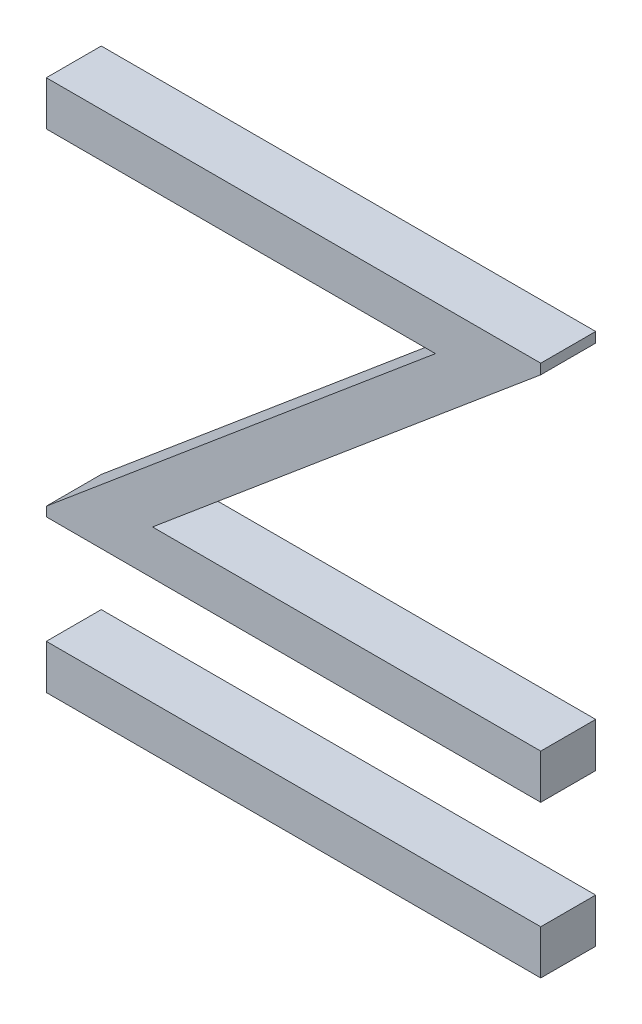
ISO-10303-21;
HEADER;
FILE_DESCRIPTION(('STEP AP214'),'2;1');
FILE_NAME('part.step','',(''),(''),'','','');
FILE_SCHEMA(('AUTOMOTIVE_DESIGN { 1 0 10303 214 1 1 1 1 }'));
ENDSEC;
DATA;
#1=APPLICATION_CONTEXT('core data for automotive mechanical design processes');
#2=APPLICATION_PROTOCOL_DEFINITION('international standard','automotive_design',2000,#1);
#3=PRODUCT_CONTEXT('',#1,'mechanical');
#4=PRODUCT('Part','Part','',(#3));
#5=PRODUCT_RELATED_PRODUCT_CATEGORY('part','',(#4));
#6=PRODUCT_DEFINITION_FORMATION('','',#4);
#7=PRODUCT_DEFINITION_CONTEXT('part definition',#1,'design');
#8=PRODUCT_DEFINITION('design','',#6,#7);
#9=PRODUCT_DEFINITION_SHAPE('','',#8);
#10=(LENGTH_UNIT() NAMED_UNIT(*) SI_UNIT(.MILLI.,.METRE.));
#11=(NAMED_UNIT(*) PLANE_ANGLE_UNIT() SI_UNIT($,.RADIAN.));
#12=(NAMED_UNIT(*) SI_UNIT($,.STERADIAN.) SOLID_ANGLE_UNIT());
#13=UNCERTAINTY_MEASURE_WITH_UNIT(LENGTH_MEASURE(1.E-05),#10,'distance_accuracy_value','');
#14=(GEOMETRIC_REPRESENTATION_CONTEXT(3) GLOBAL_UNCERTAINTY_ASSIGNED_CONTEXT((#13)) GLOBAL_UNIT_ASSIGNED_CONTEXT((#10,
#11,#12)) REPRESENTATION_CONTEXT('',''));
#15=CARTESIAN_POINT('',(0.,0.,0.));
#16=DIRECTION('',(0.,0.,1.));
#17=DIRECTION('',(1.,0.,0.));
#18=AXIS2_PLACEMENT_3D('',#15,#16,#17);
#19=CARTESIAN_POINT('',(195.,47.3076923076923,10.));
#20=DIRECTION('',(1.,0.,0.));
#21=DIRECTION('',(0.,0.,-1.));
#22=AXIS2_PLACEMENT_3D('',#19,#20,#21);
#23=PLANE('',#22);
#24=DIRECTION('',(0.,-1.,0.));
#25=VECTOR('',#24,1.);
#26=CARTESIAN_POINT('',(195.,47.3076923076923,0.));
#27=LINE('',#26,#25);
#28=CARTESIAN_POINT('',(195.,47.3076923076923,0.));
#29=VERTEX_POINT('',#28);
#30=CARTESIAN_POINT('',(195.,39.2307692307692,0.));
#31=VERTEX_POINT('',#30);
#32=EDGE_CURVE('E152',#29,#31,#27,.T.);
#33=ORIENTED_EDGE('',*,*,#32,.F.);
#34=DIRECTION('',(0.,0.,-1.));
#35=VECTOR('',#34,1.);
#36=CARTESIAN_POINT('',(195.,47.3076923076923,10.));
#37=LINE('',#36,#35);
#38=CARTESIAN_POINT('',(195.,47.3076923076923,10.));
#39=VERTEX_POINT('',#38);
#40=EDGE_CURVE('E12',#39,#29,#37,.T.);
#41=ORIENTED_EDGE('',*,*,#40,.F.);
#42=DIRECTION('',(0.,-1.,0.));
#43=VECTOR('',#42,1.);
#44=CARTESIAN_POINT('',(195.,47.3076923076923,10.));
#45=LINE('',#44,#43);
#46=CARTESIAN_POINT('',(195.,39.2307692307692,10.));
#47=VERTEX_POINT('',#46);
#48=EDGE_CURVE('E178',#39,#47,#45,.T.);
#49=ORIENTED_EDGE('',*,*,#48,.T.);
#50=DIRECTION('',(0.,0.,-1.));
#51=VECTOR('',#50,1.);
#52=CARTESIAN_POINT('',(195.,39.2307692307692,10.));
#53=LINE('',#52,#51);
#54=EDGE_CURVE('E46',#47,#31,#53,.T.);
#55=ORIENTED_EDGE('',*,*,#54,.T.);
#56=EDGE_LOOP('',(#33,#41,#49,#55));
#57=FACE_BOUND('',#56,.T.);
#58=ADVANCED_FACE('F43',(#57),#23,.T.);
#59=CARTESIAN_POINT('',(124.326923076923,47.3076923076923,10.));
#60=DIRECTION('',(0.,1.,0.));
#61=DIRECTION('',(0.,0.,1.));
#62=AXIS2_PLACEMENT_3D('',#59,#60,#61);
#63=PLANE('',#62);
#64=DIRECTION('',(1.,0.,0.));
#65=VECTOR('',#64,1.);
#66=CARTESIAN_POINT('',(124.326923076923,47.3076923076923,0.));
#67=LINE('',#66,#65);
#68=CARTESIAN_POINT('',(124.326923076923,47.3076923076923,0.));
#69=VERTEX_POINT('',#68);
#70=EDGE_CURVE('E176',#69,#29,#67,.T.);
#71=ORIENTED_EDGE('',*,*,#70,.F.);
#72=DIRECTION('',(0.,0.,-1.));
#73=VECTOR('',#72,1.);
#74=CARTESIAN_POINT('',(124.326923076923,47.3076923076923,10.));
#75=LINE('',#74,#73);
#76=CARTESIAN_POINT('',(124.326923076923,47.3076923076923,10.));
#77=VERTEX_POINT('',#76);
#78=EDGE_CURVE('E52',#77,#69,#75,.T.);
#79=ORIENTED_EDGE('',*,*,#78,.F.);
#80=DIRECTION('',(1.,0.,0.));
#81=VECTOR('',#80,1.);
#82=CARTESIAN_POINT('',(124.326923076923,47.3076923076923,10.));
#83=LINE('',#82,#81);
#84=EDGE_CURVE('E142',#77,#39,#83,.T.);
#85=ORIENTED_EDGE('',*,*,#84,.T.);
#86=ORIENTED_EDGE('',*,*,#40,.T.);
#87=EDGE_LOOP('',(#71,#79,#85,#86));
#88=FACE_BOUND('',#87,.T.);
#89=ADVANCED_FACE('F194',(#88),#63,.T.);
#90=CARTESIAN_POINT('',(195.,106.622596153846,10.));
#91=DIRECTION('',(0.642871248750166,-0.765974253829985,0.));
#92=DIRECTION('',(0.765974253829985,0.642871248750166,0.));
#93=AXIS2_PLACEMENT_3D('',#90,#91,#92);
#94=PLANE('',#93);
#95=DIRECTION('',(-0.765974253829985,-0.642871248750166,0.));
#96=VECTOR('',#95,1.);
#97=CARTESIAN_POINT('',(195.,106.622596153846,0.));
#98=LINE('',#97,#96);
#99=CARTESIAN_POINT('',(195.,106.622596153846,0.));
#100=VERTEX_POINT('',#99);
#101=EDGE_CURVE('E129',#100,#69,#98,.T.);
#102=ORIENTED_EDGE('',*,*,#101,.F.);
#103=DIRECTION('',(0.,0.,-1.));
#104=VECTOR('',#103,1.);
#105=CARTESIAN_POINT('',(195.,106.622596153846,10.));
#106=LINE('',#105,#104);
#107=CARTESIAN_POINT('',(195.,106.622596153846,10.));
#108=VERTEX_POINT('',#107);
#109=EDGE_CURVE('E124',#108,#100,#106,.T.);
#110=ORIENTED_EDGE('',*,*,#109,.F.);
#111=DIRECTION('',(-0.765974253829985,-0.642871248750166,0.));
#112=VECTOR('',#111,1.);
#113=CARTESIAN_POINT('',(195.,106.622596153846,10.));
#114=LINE('',#113,#112);
#115=EDGE_CURVE('E127',#108,#77,#114,.T.);
#116=ORIENTED_EDGE('',*,*,#115,.T.);
#117=ORIENTED_EDGE('',*,*,#78,.T.);
#118=EDGE_LOOP('',(#102,#110,#116,#117));
#119=FACE_BOUND('',#118,.T.);
#120=ADVANCED_FACE('F126',(#119),#94,.T.);
#121=CARTESIAN_POINT('',(195.,108.461538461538,10.));
#122=DIRECTION('',(1.,0.,0.));
#123=DIRECTION('',(0.,0.,-1.));
#124=AXIS2_PLACEMENT_3D('',#121,#122,#123);
#125=PLANE('',#124);
#126=DIRECTION('',(0.,-1.,0.));
#127=VECTOR('',#126,1.);
#128=CARTESIAN_POINT('',(195.,108.461538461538,0.));
#129=LINE('',#128,#127);
#130=CARTESIAN_POINT('',(195.,108.461538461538,0.));
#131=VERTEX_POINT('',#130);
#132=EDGE_CURVE('E173',#131,#100,#129,.T.);
#133=ORIENTED_EDGE('',*,*,#132,.F.);
#134=DIRECTION('',(0.,0.,-1.));
#135=VECTOR('',#134,1.);
#136=CARTESIAN_POINT('',(195.,108.461538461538,10.));
#137=LINE('',#136,#135);
#138=CARTESIAN_POINT('',(195.,108.461538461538,10.));
#139=VERTEX_POINT('',#138);
#140=EDGE_CURVE('E134',#139,#131,#137,.T.);
#141=ORIENTED_EDGE('',*,*,#140,.F.);
#142=DIRECTION('',(0.,-1.,0.));
#143=VECTOR('',#142,1.);
#144=CARTESIAN_POINT('',(195.,108.461538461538,10.));
#145=LINE('',#144,#143);
#146=EDGE_CURVE('E140',#139,#108,#145,.T.);
#147=ORIENTED_EDGE('',*,*,#146,.T.);
#148=ORIENTED_EDGE('',*,*,#109,.T.);
#149=EDGE_LOOP('',(#133,#141,#147,#148));
#150=FACE_BOUND('',#149,.T.);
#151=ADVANCED_FACE('F144',(#150),#125,.T.);
#152=CARTESIAN_POINT('',(105.,108.461538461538,10.));
#153=DIRECTION('',(0.,1.,0.));
#154=DIRECTION('',(0.,0.,1.));
#155=AXIS2_PLACEMENT_3D('',#152,#153,#154);
#156=PLANE('',#155);
#157=DIRECTION('',(1.,0.,0.));
#158=VECTOR('',#157,1.);
#159=CARTESIAN_POINT('',(105.,108.461538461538,0.));
#160=LINE('',#159,#158);
#161=CARTESIAN_POINT('',(105.,108.461538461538,0.));
#162=VERTEX_POINT('',#161);
#163=EDGE_CURVE('E170',#162,#131,#160,.T.);
#164=ORIENTED_EDGE('',*,*,#163,.F.);
#165=DIRECTION('',(0.,0.,-1.));
#166=VECTOR('',#165,1.);
#167=CARTESIAN_POINT('',(105.,108.461538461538,10.));
#168=LINE('',#167,#166);
#169=CARTESIAN_POINT('',(105.,108.461538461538,10.));
#170=VERTEX_POINT('',#169);
#171=EDGE_CURVE('E182',#170,#162,#168,.T.);
#172=ORIENTED_EDGE('',*,*,#171,.F.);
#173=DIRECTION('',(1.,0.,0.));
#174=VECTOR('',#173,1.);
#175=CARTESIAN_POINT('',(105.,108.461538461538,10.));
#176=LINE('',#175,#174);
#177=EDGE_CURVE('E145',#170,#139,#176,.T.);
#178=ORIENTED_EDGE('',*,*,#177,.T.);
#179=ORIENTED_EDGE('',*,*,#140,.T.);
#180=EDGE_LOOP('',(#164,#172,#178,#179));
#181=FACE_BOUND('',#180,.T.);
#182=ADVANCED_FACE('F207',(#181),#156,.T.);
#183=CARTESIAN_POINT('',(105.,100.384615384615,10.));
#184=DIRECTION('',(-1.,0.,0.));
#185=DIRECTION('',(0.,0.,1.));
#186=AXIS2_PLACEMENT_3D('',#183,#184,#185);
#187=PLANE('',#186);
#188=DIRECTION('',(0.,1.,0.));
#189=VECTOR('',#188,1.);
#190=CARTESIAN_POINT('',(105.,100.384615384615,0.));
#191=LINE('',#190,#189);
#192=CARTESIAN_POINT('',(105.,100.384615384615,0.));
#193=VERTEX_POINT('',#192);
#194=EDGE_CURVE('E167',#193,#162,#191,.T.);
#195=ORIENTED_EDGE('',*,*,#194,.F.);
#196=DIRECTION('',(0.,0.,-1.));
#197=VECTOR('',#196,1.);
#198=CARTESIAN_POINT('',(105.,100.384615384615,10.));
#199=LINE('',#198,#197);
#200=CARTESIAN_POINT('',(105.,100.384615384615,10.));
#201=VERTEX_POINT('',#200);
#202=EDGE_CURVE('E184',#201,#193,#199,.T.);
#203=ORIENTED_EDGE('',*,*,#202,.F.);
#204=DIRECTION('',(0.,1.,0.));
#205=VECTOR('',#204,1.);
#206=CARTESIAN_POINT('',(105.,100.384615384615,10.));
#207=LINE('',#206,#205);
#208=EDGE_CURVE('E147',#201,#170,#207,.T.);
#209=ORIENTED_EDGE('',*,*,#208,.T.);
#210=ORIENTED_EDGE('',*,*,#171,.T.);
#211=EDGE_LOOP('',(#195,#203,#209,#210));
#212=FACE_BOUND('',#211,.T.);
#213=ADVANCED_FACE('F210',(#212),#187,.T.);
#214=CARTESIAN_POINT('',(175.835336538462,100.384615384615,10.));
#215=DIRECTION('',(0.,-1.,0.));
#216=DIRECTION('',(0.,0.,-1.));
#217=AXIS2_PLACEMENT_3D('',#214,#215,#216);
#218=PLANE('',#217);
#219=DIRECTION('',(-1.,0.,0.));
#220=VECTOR('',#219,1.);
#221=CARTESIAN_POINT('',(175.835336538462,100.384615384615,0.));
#222=LINE('',#221,#220);
#223=CARTESIAN_POINT('',(175.835336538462,100.384615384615,0.));
#224=VERTEX_POINT('',#223);
#225=EDGE_CURVE('E164',#224,#193,#222,.T.);
#226=ORIENTED_EDGE('',*,*,#225,.F.);
#227=DIRECTION('',(0.,0.,-1.));
#228=VECTOR('',#227,1.);
#229=CARTESIAN_POINT('',(175.835336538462,100.384615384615,10.));
#230=LINE('',#229,#228);
#231=CARTESIAN_POINT('',(175.835336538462,100.384615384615,10.));
#232=VERTEX_POINT('',#231);
#233=EDGE_CURVE('E186',#232,#224,#230,.T.);
#234=ORIENTED_EDGE('',*,*,#233,.F.);
#235=DIRECTION('',(-1.,0.,0.));
#236=VECTOR('',#235,1.);
#237=CARTESIAN_POINT('',(175.835336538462,100.384615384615,10.));
#238=LINE('',#237,#236);
#239=EDGE_CURVE('E321',#232,#201,#238,.T.);
#240=ORIENTED_EDGE('',*,*,#239,.T.);
#241=ORIENTED_EDGE('',*,*,#202,.T.);
#242=EDGE_LOOP('',(#226,#234,#240,#241));
#243=FACE_BOUND('',#242,.T.);
#244=ADVANCED_FACE('F214',(#243),#218,.T.);
#245=CARTESIAN_POINT('',(105.,40.9254807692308,10.));
#246=DIRECTION('',(-0.642922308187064,0.76593139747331,0.));
#247=DIRECTION('',(-0.76593139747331,-0.642922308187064,0.));
#248=AXIS2_PLACEMENT_3D('',#245,#246,#247);
#249=PLANE('',#248);
#250=DIRECTION('',(0.76593139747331,0.642922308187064,0.));
#251=VECTOR('',#250,1.);
#252=CARTESIAN_POINT('',(105.,40.9254807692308,0.));
#253=LINE('',#252,#251);
#254=CARTESIAN_POINT('',(105.,40.9254807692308,0.));
#255=VERTEX_POINT('',#254);
#256=EDGE_CURVE('E161',#255,#224,#253,.T.);
#257=ORIENTED_EDGE('',*,*,#256,.F.);
#258=DIRECTION('',(0.,0.,-1.));
#259=VECTOR('',#258,1.);
#260=CARTESIAN_POINT('',(105.,40.9254807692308,10.));
#261=LINE('',#260,#259);
#262=CARTESIAN_POINT('',(105.,40.9254807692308,10.));
#263=VERTEX_POINT('',#262);
#264=EDGE_CURVE('E188',#263,#255,#261,.T.);
#265=ORIENTED_EDGE('',*,*,#264,.F.);
#266=DIRECTION('',(0.76593139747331,0.642922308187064,0.));
#267=VECTOR('',#266,1.);
#268=CARTESIAN_POINT('',(105.,40.9254807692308,10.));
#269=LINE('',#268,#267);
#270=EDGE_CURVE('E317',#263,#232,#269,.T.);
#271=ORIENTED_EDGE('',*,*,#270,.T.);
#272=ORIENTED_EDGE('',*,*,#233,.T.);
#273=EDGE_LOOP('',(#257,#265,#271,#272));
#274=FACE_BOUND('',#273,.T.);
#275=ADVANCED_FACE('F218',(#274),#249,.T.);
#276=CARTESIAN_POINT('',(105.,39.2307692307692,10.));
#277=DIRECTION('',(-1.,0.,0.));
#278=DIRECTION('',(0.,0.,1.));
#279=AXIS2_PLACEMENT_3D('',#276,#277,#278);
#280=PLANE('',#279);
#281=DIRECTION('',(0.,1.,0.));
#282=VECTOR('',#281,1.);
#283=CARTESIAN_POINT('',(105.,39.2307692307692,0.));
#284=LINE('',#283,#282);
#285=CARTESIAN_POINT('',(105.,39.2307692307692,0.));
#286=VERTEX_POINT('',#285);
#287=EDGE_CURVE('E158',#286,#255,#284,.T.);
#288=ORIENTED_EDGE('',*,*,#287,.F.);
#289=DIRECTION('',(0.,0.,-1.));
#290=VECTOR('',#289,1.);
#291=CARTESIAN_POINT('',(105.,39.2307692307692,10.));
#292=LINE('',#291,#290);
#293=CARTESIAN_POINT('',(105.,39.2307692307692,10.));
#294=VERTEX_POINT('',#293);
#295=EDGE_CURVE('E189',#294,#286,#292,.T.);
#296=ORIENTED_EDGE('',*,*,#295,.F.);
#297=DIRECTION('',(0.,1.,0.));
#298=VECTOR('',#297,1.);
#299=CARTESIAN_POINT('',(105.,39.2307692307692,10.));
#300=LINE('',#299,#298);
#301=EDGE_CURVE('E328',#294,#263,#300,.T.);
#302=ORIENTED_EDGE('',*,*,#301,.T.);
#303=ORIENTED_EDGE('',*,*,#264,.T.);
#304=EDGE_LOOP('',(#288,#296,#302,#303));
#305=FACE_BOUND('',#304,.T.);
#306=ADVANCED_FACE('F222',(#305),#280,.T.);
#307=CARTESIAN_POINT('',(195.,39.2307692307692,10.));
#308=DIRECTION('',(0.,-1.,0.));
#309=DIRECTION('',(0.,0.,-1.));
#310=AXIS2_PLACEMENT_3D('',#307,#308,#309);
#311=PLANE('',#310);
#312=DIRECTION('',(-1.,0.,0.));
#313=VECTOR('',#312,1.);
#314=CARTESIAN_POINT('',(195.,39.2307692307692,0.));
#315=LINE('',#314,#313);
#316=EDGE_CURVE('E155',#31,#286,#315,.T.);
#317=ORIENTED_EDGE('',*,*,#316,.F.);
#318=ORIENTED_EDGE('',*,*,#54,.F.);
#319=DIRECTION('',(-1.,0.,0.));
#320=VECTOR('',#319,1.);
#321=CARTESIAN_POINT('',(195.,39.2307692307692,10.));
#322=LINE('',#321,#320);
#323=EDGE_CURVE('E330',#47,#294,#322,.T.);
#324=ORIENTED_EDGE('',*,*,#323,.T.);
#325=ORIENTED_EDGE('',*,*,#295,.T.);
#326=EDGE_LOOP('',(#317,#318,#324,#325));
#327=FACE_BOUND('',#326,.T.);
#328=ADVANCED_FACE('F191',(#327),#311,.T.);
#329=CARTESIAN_POINT('',(0.,0.,10.));
#330=DIRECTION('',(0.,0.,-1.));
#331=DIRECTION('',(-1.,0.,0.));
#332=AXIS2_PLACEMENT_3D('',#329,#330,#331);
#333=PLANE('',#332);
#334=ORIENTED_EDGE('',*,*,#48,.F.);
#335=ORIENTED_EDGE('',*,*,#84,.F.);
#336=ORIENTED_EDGE('',*,*,#115,.F.);
#337=ORIENTED_EDGE('',*,*,#146,.F.);
#338=ORIENTED_EDGE('',*,*,#177,.F.);
#339=ORIENTED_EDGE('',*,*,#208,.F.);
#340=ORIENTED_EDGE('',*,*,#239,.F.);
#341=ORIENTED_EDGE('',*,*,#270,.F.);
#342=ORIENTED_EDGE('',*,*,#301,.F.);
#343=ORIENTED_EDGE('',*,*,#323,.F.);
#344=EDGE_LOOP('',(#334,#335,#336,#337,#338,#339,#340,#341,#342,#343));
#345=FACE_BOUND('',#344,.T.);
#346=ADVANCED_FACE('F138',(#345),#333,.F.);
#347=CARTESIAN_POINT('',(0.,0.,0.));
#348=DIRECTION('',(0.,0.,-1.));
#349=DIRECTION('',(-1.,0.,0.));
#350=AXIS2_PLACEMENT_3D('',#347,#348,#349);
#351=PLANE('',#350);
#352=ORIENTED_EDGE('',*,*,#32,.T.);
#353=ORIENTED_EDGE('',*,*,#316,.T.);
#354=ORIENTED_EDGE('',*,*,#287,.T.);
#355=ORIENTED_EDGE('',*,*,#256,.T.);
#356=ORIENTED_EDGE('',*,*,#225,.T.);
#357=ORIENTED_EDGE('',*,*,#194,.T.);
#358=ORIENTED_EDGE('',*,*,#163,.T.);
#359=ORIENTED_EDGE('',*,*,#132,.T.);
#360=ORIENTED_EDGE('',*,*,#101,.T.);
#361=ORIENTED_EDGE('',*,*,#70,.T.);
#362=EDGE_LOOP('',(#352,#353,#354,#355,#356,#357,#358,#359,#360,#361));
#363=FACE_BOUND('',#362,.T.);
#364=ADVANCED_FACE('F193',(#363),#351,.T.);
#365=CLOSED_SHELL('',(#58,#89,#120,#151,#182,#213,#244,#275,#306,#328,#346,#364));
#366=MANIFOLD_SOLID_BREP('B2',#365);
#367=CARTESIAN_POINT('',(195.,11.5384615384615,10.));
#368=DIRECTION('',(0.,-1.,0.));
#369=DIRECTION('',(0.,0.,-1.));
#370=AXIS2_PLACEMENT_3D('',#367,#368,#369);
#371=PLANE('',#370);
#372=DIRECTION('',(-1.,0.,0.));
#373=VECTOR('',#372,1.);
#374=CARTESIAN_POINT('',(195.,11.5384615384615,0.));
#375=LINE('',#374,#373);
#376=CARTESIAN_POINT('',(195.,11.5384615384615,0.));
#377=VERTEX_POINT('',#376);
#378=CARTESIAN_POINT('',(105.,11.5384615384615,0.));
#379=VERTEX_POINT('',#378);
#380=EDGE_CURVE('E399',#377,#379,#375,.T.);
#381=ORIENTED_EDGE('',*,*,#380,.F.);
#382=DIRECTION('',(0.,0.,-1.));
#383=VECTOR('',#382,1.);
#384=CARTESIAN_POINT('',(195.,11.5384615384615,10.));
#385=LINE('',#384,#383);
#386=CARTESIAN_POINT('',(195.,11.5384615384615,10.));
#387=VERTEX_POINT('',#386);
#388=EDGE_CURVE('E41',#387,#377,#385,.T.);
#389=ORIENTED_EDGE('',*,*,#388,.F.);
#390=DIRECTION('',(-1.,0.,0.));
#391=VECTOR('',#390,1.);
#392=CARTESIAN_POINT('',(195.,11.5384615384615,10.));
#393=LINE('',#392,#391);
#394=CARTESIAN_POINT('',(105.,11.5384615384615,10.));
#395=VERTEX_POINT('',#394);
#396=EDGE_CURVE('E393',#387,#395,#393,.T.);
#397=ORIENTED_EDGE('',*,*,#396,.T.);
#398=DIRECTION('',(0.,0.,-1.));
#399=VECTOR('',#398,1.);
#400=CARTESIAN_POINT('',(105.,11.5384615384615,10.));
#401=LINE('',#400,#399);
#402=EDGE_CURVE('E338',#395,#379,#401,.T.);
#403=ORIENTED_EDGE('',*,*,#402,.T.);
#404=EDGE_LOOP('',(#381,#389,#397,#403));
#405=FACE_BOUND('',#404,.T.);
#406=ADVANCED_FACE('F335',(#405),#371,.T.);
#407=CARTESIAN_POINT('',(195.,19.6153846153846,10.));
#408=DIRECTION('',(1.,0.,0.));
#409=DIRECTION('',(0.,0.,-1.));
#410=AXIS2_PLACEMENT_3D('',#407,#408,#409);
#411=PLANE('',#410);
#412=DIRECTION('',(0.,-1.,0.));
#413=VECTOR('',#412,1.);
#414=CARTESIAN_POINT('',(195.,19.6153846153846,0.));
#415=LINE('',#414,#413);
#416=CARTESIAN_POINT('',(195.,19.6153846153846,0.));
#417=VERTEX_POINT('',#416);
#418=EDGE_CURVE('E395',#417,#377,#415,.T.);
#419=ORIENTED_EDGE('',*,*,#418,.F.);
#420=DIRECTION('',(0.,0.,-1.));
#421=VECTOR('',#420,1.);
#422=CARTESIAN_POINT('',(195.,19.6153846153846,10.));
#423=LINE('',#422,#421);
#424=CARTESIAN_POINT('',(195.,19.6153846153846,10.));
#425=VERTEX_POINT('',#424);
#426=EDGE_CURVE('E344',#425,#417,#423,.T.);
#427=ORIENTED_EDGE('',*,*,#426,.F.);
#428=DIRECTION('',(0.,-1.,0.));
#429=VECTOR('',#428,1.);
#430=CARTESIAN_POINT('',(195.,19.6153846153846,10.));
#431=LINE('',#430,#429);
#432=EDGE_CURVE('E390',#425,#387,#431,.T.);
#433=ORIENTED_EDGE('',*,*,#432,.T.);
#434=ORIENTED_EDGE('',*,*,#388,.T.);
#435=EDGE_LOOP('',(#419,#427,#433,#434));
#436=FACE_BOUND('',#435,.T.);
#437=ADVANCED_FACE('F409',(#436),#411,.T.);
#438=CARTESIAN_POINT('',(105.,19.6153846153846,10.));
#439=DIRECTION('',(0.,1.,0.));
#440=DIRECTION('',(0.,0.,1.));
#441=AXIS2_PLACEMENT_3D('',#438,#439,#440);
#442=PLANE('',#441);
#443=DIRECTION('',(1.,0.,0.));
#444=VECTOR('',#443,1.);
#445=CARTESIAN_POINT('',(105.,19.6153846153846,0.));
#446=LINE('',#445,#444);
#447=CARTESIAN_POINT('',(105.,19.6153846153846,0.));
#448=VERTEX_POINT('',#447);
#449=EDGE_CURVE('E385',#448,#417,#446,.T.);
#450=ORIENTED_EDGE('',*,*,#449,.F.);
#451=DIRECTION('',(0.,0.,-1.));
#452=VECTOR('',#451,1.);
#453=CARTESIAN_POINT('',(105.,19.6153846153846,10.));
#454=LINE('',#453,#452);
#455=CARTESIAN_POINT('',(105.,19.6153846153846,10.));
#456=VERTEX_POINT('',#455);
#457=EDGE_CURVE('E380',#456,#448,#454,.T.);
#458=ORIENTED_EDGE('',*,*,#457,.F.);
#459=DIRECTION('',(1.,0.,0.));
#460=VECTOR('',#459,1.);
#461=CARTESIAN_POINT('',(105.,19.6153846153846,10.));
#462=LINE('',#461,#460);
#463=EDGE_CURVE('E383',#456,#425,#462,.T.);
#464=ORIENTED_EDGE('',*,*,#463,.T.);
#465=ORIENTED_EDGE('',*,*,#426,.T.);
#466=EDGE_LOOP('',(#450,#458,#464,#465));
#467=FACE_BOUND('',#466,.T.);
#468=ADVANCED_FACE('F382',(#467),#442,.T.);
#469=CARTESIAN_POINT('',(105.,11.5384615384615,10.));
#470=DIRECTION('',(-1.,0.,0.));
#471=DIRECTION('',(0.,0.,1.));
#472=AXIS2_PLACEMENT_3D('',#469,#470,#471);
#473=PLANE('',#472);
#474=DIRECTION('',(0.,1.,0.));
#475=VECTOR('',#474,1.);
#476=CARTESIAN_POINT('',(105.,11.5384615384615,0.));
#477=LINE('',#476,#475);
#478=EDGE_CURVE('E402',#379,#448,#477,.T.);
#479=ORIENTED_EDGE('',*,*,#478,.F.);
#480=ORIENTED_EDGE('',*,*,#402,.F.);
#481=DIRECTION('',(0.,1.,0.));
#482=VECTOR('',#481,1.);
#483=CARTESIAN_POINT('',(105.,11.5384615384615,10.));
#484=LINE('',#483,#482);
#485=EDGE_CURVE('E389',#395,#456,#484,.T.);
#486=ORIENTED_EDGE('',*,*,#485,.T.);
#487=ORIENTED_EDGE('',*,*,#457,.T.);
#488=EDGE_LOOP('',(#479,#480,#486,#487));
#489=FACE_BOUND('',#488,.T.);
#490=ADVANCED_FACE('F392',(#489),#473,.T.);
#491=CARTESIAN_POINT('',(0.,0.,10.));
#492=DIRECTION('',(0.,0.,-1.));
#493=DIRECTION('',(-1.,0.,0.));
#494=AXIS2_PLACEMENT_3D('',#491,#492,#493);
#495=PLANE('',#494);
#496=ORIENTED_EDGE('',*,*,#396,.F.);
#497=ORIENTED_EDGE('',*,*,#432,.F.);
#498=ORIENTED_EDGE('',*,*,#463,.F.);
#499=ORIENTED_EDGE('',*,*,#485,.F.);
#500=EDGE_LOOP('',(#496,#497,#498,#499));
#501=FACE_BOUND('',#500,.T.);
#502=ADVANCED_FACE('F388',(#501),#495,.F.);
#503=CARTESIAN_POINT('',(0.,0.,0.));
#504=DIRECTION('',(0.,0.,-1.));
#505=DIRECTION('',(-1.,0.,0.));
#506=AXIS2_PLACEMENT_3D('',#503,#504,#505);
#507=PLANE('',#506);
#508=ORIENTED_EDGE('',*,*,#380,.T.);
#509=ORIENTED_EDGE('',*,*,#478,.T.);
#510=ORIENTED_EDGE('',*,*,#449,.T.);
#511=ORIENTED_EDGE('',*,*,#418,.T.);
#512=EDGE_LOOP('',(#508,#509,#510,#511));
#513=FACE_BOUND('',#512,.T.);
#514=ADVANCED_FACE('F408',(#513),#507,.T.);
#515=CLOSED_SHELL('',(#406,#437,#468,#490,#502,#514));
#516=MANIFOLD_SOLID_BREP('B6',#515);
#517=ADVANCED_BREP_SHAPE_REPRESENTATION('',(#18,#366,#516),#14);
#518=SHAPE_DEFINITION_REPRESENTATION(#9,#517);
ENDSEC;
END-ISO-10303-21;
